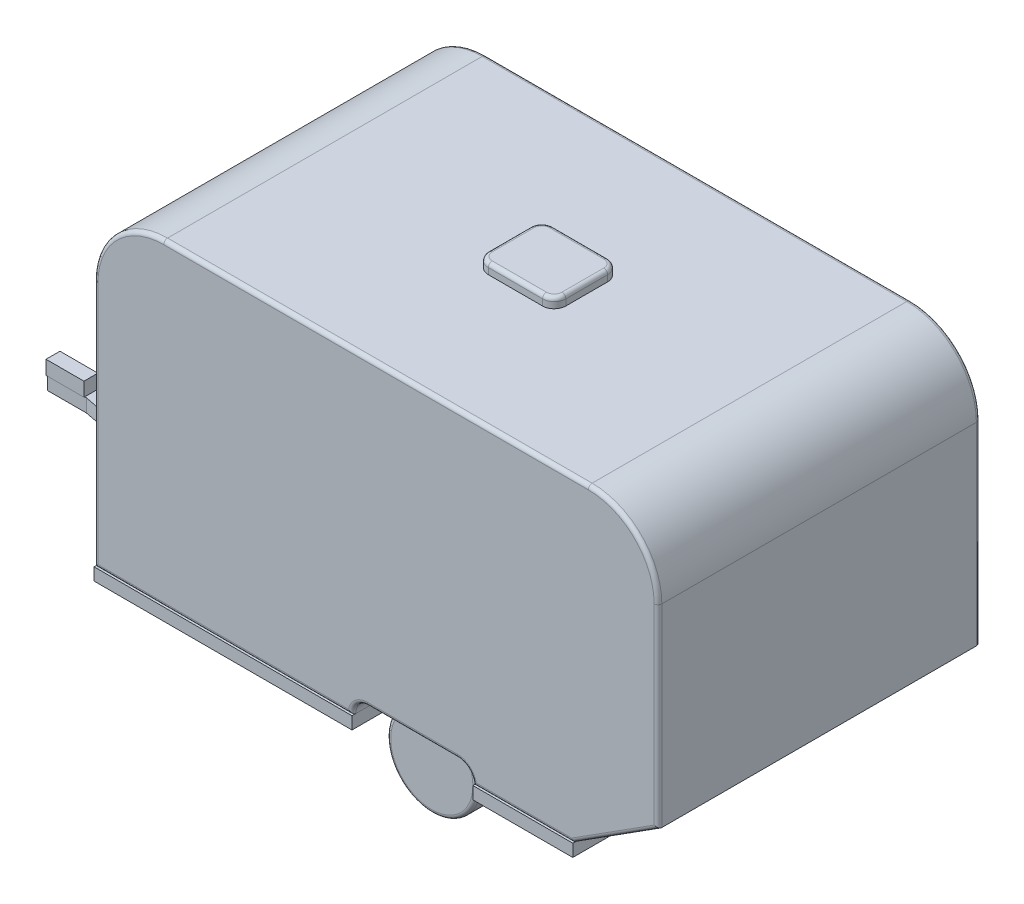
from build123d import *

# Parameters (mm, degrees)
ESQUISSE1_W              = 3090
ESQUISSE1_H              = 2080
ESQUISSE1_W_2            = 3010
ESQUISSE1_H_2            = 2000
BOSS_EXTRU_1_DEPTH       = 80
ESQUISSE2_W              = 3010
ESQUISSE2_H              = 40
ESQUISSE2_W_2            = 40
ESQUISSE2_H_2            = 335
BOSS_EXTRU_7_DEPTH       = 80
BOSS_EXTRU_8_START       = 20
BOSS_EXTRU_8_DEPTH       = 60
ESQUISSE5_W              = 780
ESQUISSE5_H              = 50
ENL_V_MAT_EXTRU_5_DEPTH  = 3726.70798641
ESQUISSE6_W              = 95
ESQUISSE6_H              = 1330
BOSS_EXTRU_9_DEPTH       = 95
CONG_1_R                 = 10
BOSS_EXTRU_10_DEPTH      = 95
BOSS_EXTRU_10_DEPTH_BACK = 1422
ESQUISSE8_R              = 35
ESQUISSE9_R              = 290
BOSS_EXTRU_11_DEPTH      = 155
BOSS_EXTRU_12_START      = 155
ESQUISSE10_R             = 290
BOSS_EXTRU_12_DEPTH      = 155
CONG_2_R                 = 25
BOSS_EXTRU_26_DEPTH      = 85
ESQUISSE12_W             = 245
ESQUISSE12_H             = 90
BOSS_EXTRU_27_DEPTH      = 90
BOSS_EXTRU_28_DEPTH      = 2080
BOSS_EXTRU_29_START      = 25
BOSS_EXTRU_29_DEPTH      = 65
CONG_3_R                 = 25
CONG_4_R                 = 25
BOSS_EXTRU_30_DEPTH      = 30
CONG_5_R                 = 25
BOSS_EXTRU_31_DEPTH      = 30
CONG_6_R                 = 25
ESQUISSE18_R             = 42.5
ENL_V_MAT_EXTRU_6_DEPTH  = 15
ESQUISSE19_W             = 2400
ESQUISSE19_H             = 125
ESQUISSE19_W_2           = 640
ESQUISSE19_H_2           = 40
ENL_V_MAT_EXTRU_7_DEPTH  = 10
ESQUISSE20_W             = 2030
ESQUISSE20_H             = 125
ESQUISSE20_H_2           = 40
ENL_V_MAT_EXTRU_8_DEPTH  = 10
BOSS_EXTRU_33_START      = -500
BOSS_EXTRU_33_DEPTH      = 1080
CONG_7_R                 = 50


with BuildPart() as part:
    # Esquisse1 → Boss.-Extru.1 (new body)
    with BuildSketch(Plane(origin=(0, 0, 0), x_dir=(1, 0, 0), z_dir=(0, 1, 0))):
        with Locations((1545, 1040)):
            Rectangle(ESQUISSE1_W, ESQUISSE1_H)
        with Locations((1545, 1040)):
            Rectangle(ESQUISSE1_W_2, ESQUISSE1_H_2, mode=Mode.SUBTRACT)
    extrude(amount=BOSS_EXTRU_1_DEPTH)

    # Esquisse2 → Boss.-Extru.7 (add)
    with BuildSketch(Plane(origin=(0, 0, 0), x_dir=(1, 0, 0), z_dir=(0, 1, 0))):
        with Locations((1545, 1685)):
            Rectangle(ESQUISSE2_W, ESQUISSE2_H)
        with Locations((1545, 395)):
            Rectangle(ESQUISSE2_W, ESQUISSE2_H)
        with Locations((1645, 1872.5)):
            Rectangle(ESQUISSE2_W_2, ESQUISSE2_H_2)
        with Locations((2465, 1872.5)):
            Rectangle(ESQUISSE2_W_2, ESQUISSE2_H_2)
        with Locations((1645, 207.5)):
            Rectangle(ESQUISSE2_W_2, ESQUISSE2_H_2)
        with Locations((2465, 207.5)):
            Rectangle(ESQUISSE2_W_2, ESQUISSE2_H_2)
    extrude(amount=BOSS_EXTRU_7_DEPTH)

    # Esquisse4 → Boss.-Extru.8 (add)
    with BuildSketch(Plane(origin=(0, 0, 0), x_dir=(1, 0, 0), z_dir=(0, 1, 0)).offset(BOSS_EXTRU_8_START)):
        Polygon((40, 1050), (585, 1050), (585, 1665), (615, 1665), (615, 1050), (1185, 1050), (1185, 1665), (1215, 1665), (1215, 1050), (2745, 1050), (2745, 1665), (2775, 1665), (2775, 1432.5), (3050, 1432.5), (3050, 1412.5), (2775, 1412.5), (2775, 667.5), (3050, 667.5), (3050, 647.5), (2775, 647.5), (2775, 415), (2745, 415), (2745, 1030), (1215, 1030), (1215, 415), (1185, 415), (1185, 1030), (615, 1030), (615, 415), (585, 415), (585, 1030), (40, 1030), align=None)
    extrude(amount=BOSS_EXTRU_8_DEPTH)

    # Esquisse5 → Enl_v. mat.-Extru.5 (cut, through all)
    with BuildSketch(Plane(origin=(0, 0, 0), x_dir=(1, 0, 0), z_dir=(0, 1, 0))):
        with Locations((2055, 2065)):
            Rectangle(ESQUISSE5_W, ESQUISSE5_H)
        with Locations((2055, 15)):
            Rectangle(ESQUISSE5_W, ESQUISSE5_H)
    extrude(amount=ENL_V_MAT_EXTRU_5_DEPTH, mode=Mode.SUBTRACT)

    # Esquisse6 → Boss.-Extru.9 (add)
    with BuildSketch(Plane(origin=(0, 0, 0), x_dir=(1, 0, 0), z_dir=(0, 1, 0))):
        with Locations((2055, 1040)):
            Rectangle(ESQUISSE6_W, ESQUISSE6_H)
    extrude(amount=-BOSS_EXTRU_9_DEPTH)

    # Cong_1
    cong_1_edges = [part.edges().sort_by_distance(p)[0] for p in [
        (2007.5, 0, -1040),
        (2102.5, 0, -1040),
        (2007.5, -95, -1040),
        (2102.5, -95, -1040),
    ]]
    fillet(cong_1_edges, radius=CONG_1_R)

    # Esquisse8 → Boss.-Extru.10 (add, two sides: drawn at the far end of the back side and taken through both)
    with BuildSketch(Plane.XY.offset(-375).offset(-BOSS_EXTRU_10_DEPTH_BACK)):
        with Locations((2055, -47.5)):
            Circle(ESQUISSE8_R)
    extrude(amount=BOSS_EXTRU_10_DEPTH + BOSS_EXTRU_10_DEPTH_BACK)

    # Esquisse9 → Boss.-Extru.11 (add)
    with BuildSketch(Plane.XY.offset(-280)):
        with Locations((2055, -47.5)):
            Circle(ESQUISSE9_R)
    extrude(amount=BOSS_EXTRU_11_DEPTH)

    # Esquisse10 → Boss.-Extru.12 (add)
    with BuildSketch(Plane(origin=(0, 0, -1797), x_dir=(-1, 0, 0), z_dir=(0, 0, -1)).offset(BOSS_EXTRU_12_START)):
        with Locations(Location((-2055, -47.5, 0), (0, 0, 180))):
            Circle(ESQUISSE10_R)
    extrude(amount=-BOSS_EXTRU_12_DEPTH)

    # Cong_2
    cong_2_edges = [part.edges().sort_by_distance(p)[0] for p in [
        (1765, -47.5, -280),
        (1765, -47.5, -125),
        (1765, -47.5, -1797),
        (1765, -47.5, -1952),
    ]]
    fillet(cong_2_edges, radius=CONG_2_R)



with BuildPart() as body_2:
    # Esquisse11 → Boss.-Extru.26 (new body)
    with BuildSketch(Plane.XZ):
        Polygon((-1300, -1080), (-1050, -1080), (2007.5, -1665), (2007.5, -1620), (-1021.254273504, -1040.5), (-1021.254273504, -1039.5), (2007.5, -460), (2007.5, -415), (-1050, -1000), (-1300, -1000), align=None)
    extrude(amount=BOSS_EXTRU_26_DEPTH)

    # Esquisse12 → Boss.-Extru.27 (add)
    with BuildSketch(Plane(origin=(0, 0, 0), x_dir=(1, 0, 0), z_dir=(0, 1, 0))):
        with Locations((-1182.5, 1040)):
            Rectangle(ESQUISSE12_W, ESQUISSE12_H)
    extrude(amount=BOSS_EXTRU_27_DEPTH)


with BuildPart() as body_3:
    # Esquisse14 → Boss.-Extru.28 (new body)
    with BuildSketch(Plane(origin=(0, 0, -2080), x_dir=(-1, 0, 0), z_dir=(0, 0, -1))):
        with BuildLine():
            Line((0, 80), (0, 1680))
            ThreePointArc((0, 1680), (-131.801948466, 1998.198051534), (-450, 2130))
            Line((-450, 2130), (-3190, 2130))
            ThreePointArc((-3190, 2130), (-3508.198051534, 1998.198051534), (-3640, 1680))
            Line((-3640, 1680), (-3640, 430))
            Line((-3640, 430), (-3090, 80))
            Line((-3090, 80), (-2445, 80))
            ThreePointArc((-2445, 80), (-2415.710678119, 150.710678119), (-2345, 180))
            Line((-2345, 180), (-1765, 180))
            ThreePointArc((-1765, 180), (-1694.289321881, 150.710678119), (-1665, 80))
            Line((-1665, 80), (0, 80))
        make_face()
    extrude(amount=-BOSS_EXTRU_28_DEPTH)

    # Cong_4
    cong_4_edges = [body_3.edges().sort_by_distance(p)[0] for p in [
        (131.801948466, 1998.198051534, 0),
        (1694.289321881, 150.710678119, -2080),
        (2055, 180, -2080),
        (2415.710678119, 150.710678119, -2080),
        (2767.5, 80, -2080),
        (3365, 255, -2080),
        (3640, 1055, -2080),
        (3508.198051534, 1998.198051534, -2080),
        (1820, 2130, -2080),
        (1820, 2130, 0),
        (131.801948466, 1998.198051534, -2080),
        (0, 880, -2080),
        (832.5, 80, -2080),
        (3508.198051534, 1998.198051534, 0),
        (3640, 1055, 0),
        (3365, 255, 0),
        (2767.5, 80, 0),
        (2415.710678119, 150.710678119, 0),
        (2055, 180, 0),
        (1694.289321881, 150.710678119, 0),
        (832.5, 80, 0),
        (0, 880, 0),
    ]]
    fillet(cong_4_edges, radius=CONG_4_R)


with BuildPart() as body_4:
    # Esquisse15 → Boss.-Extru.29 (new body)
    with BuildSketch(Plane(origin=(0, 2130, 0), x_dir=(1, 0, 0), z_dir=(0, 1, 0)).offset(BOSS_EXTRU_29_START)):
        with BuildLine():
            Line((1715, 1250), (2065, 1250))
            ThreePointArc((2065, 1250), (2118.033008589, 1228.033008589), (2140, 1175))
            Line((2140, 1175), (2140, 905))
            ThreePointArc((2140, 905), (2118.033008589, 851.966991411), (2065, 830))
            Line((2065, 830), (1715, 830))
            ThreePointArc((1715, 830), (1661.966991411, 851.966991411), (1640, 905))
            Line((1640, 905), (1640, 1175))
            ThreePointArc((1640, 1175), (1661.966991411, 1228.033008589), (1715, 1250))
        make_face()
    extrude(amount=BOSS_EXTRU_29_DEPTH)

    # Cong_3
    cong_3_edges = [body_4.edges().sort_by_distance(p)[0] for p in [
        (2118.033008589, 2220, -851.966991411),
        (2140, 2220, -1040),
        (2118.033008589, 2220, -1228.033008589),
        (1890, 2220, -1250),
        (1661.966991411, 2220, -1228.033008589),
        (1640, 2220, -1040),
        (1661.966991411, 2220, -851.966991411),
        (1890, 2220, -830),
    ]]
    fillet(cong_3_edges, radius=CONG_3_R)


with BuildPart() as part_1:
    add(part.part)

    add(body_3.part)  # Boss.-Extru.30 merges body 3
    # Esquisse16 → Boss.-Extru.30 (add)
    with BuildSketch(Plane(origin=(0, 0, -2080), x_dir=(-1, 0, 0), z_dir=(0, 0, -1))):
        with BuildLine():
            Line((-1215, 105), (-665, 105))
            Line((-665, 105), (-665, 1730))
            ThreePointArc((-665, 1730), (-716.256313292, 1853.743686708), (-840, 1905))
            Line((-840, 1905), (-1040, 1905))
            ThreePointArc((-1040, 1905), (-1163.743686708, 1853.743686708), (-1215, 1730))
            Line((-1215, 1730), (-1215, 105))
        make_face()
        with BuildLine():
            Line((-3335, 1610), (-2585, 1610))
            ThreePointArc((-2585, 1610), (-2531.966991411, 1588.033008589), (-2510, 1535))
            Line((-2510, 1535), (-2510, 1035))
            ThreePointArc((-2510, 1035), (-2531.966991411, 981.966991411), (-2585, 960))
            Line((-2585, 960), (-3335, 960))
            ThreePointArc((-3335, 960), (-3388.033008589, 981.966991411), (-3410, 1035))
            Line((-3410, 1035), (-3410, 1535))
            ThreePointArc((-3410, 1535), (-3388.033008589, 1588.033008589), (-3335, 1610))
        make_face()
    extrude(amount=BOSS_EXTRU_30_DEPTH)

    # Cong_5
    cong_5_edges = [part_1.edges().sort_by_distance(p)[0] for p in [
        (1215, 917.5, -2110),
        (940, 105, -2110),
        (665, 917.5, -2110),
        (716.256313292, 1853.743686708, -2110),
        (940, 1905, -2110),
        (1163.743686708, 1853.743686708, -2110),
        (3388.033008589, 981.966991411, -2110),
        (2960, 960, -2110),
        (2531.966991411, 981.966991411, -2110),
        (2510, 1285, -2110),
        (2531.966991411, 1588.033008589, -2110),
        (2960, 1610, -2110),
        (3388.033008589, 1588.033008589, -2110),
        (3410, 1285, -2110),
    ]]
    fillet(cong_5_edges, radius=CONG_5_R)

    # Esquisse17 → Boss.-Extru.31 (add)
    with BuildSketch(Plane.ZY):
        with BuildLine():
            Line((-1867, 1660), (-217, 1660))
            ThreePointArc((-217, 1660), (-163.966991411, 1638.033008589), (-142, 1585))
            Line((-142, 1585), (-142, 1035))
            ThreePointArc((-142, 1035), (-163.966991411, 981.966991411), (-217, 960))
            Line((-217, 960), (-1867, 960))
            ThreePointArc((-1867, 960), (-1920.033008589, 981.966991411), (-1942, 1035))
            Line((-1942, 1035), (-1942, 1585))
            ThreePointArc((-1942, 1585), (-1920.033008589, 1638.033008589), (-1867, 1660))
        make_face()
    extrude(amount=BOSS_EXTRU_31_DEPTH)

    # Cong_6
    cong_6_edges = [part_1.edges().sort_by_distance(p)[0] for p in [
        (-30, 981.966991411, -1920.033008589),
        (-30, 960, -1042),
        (-30, 981.966991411, -163.966991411),
        (-30, 1310, -142),
        (-30, 1638.033008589, -163.966991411),
        (-30, 1660, -1042),
        (-30, 1638.033008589, -1920.033008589),
        (-30, 1310, -1942),
    ]]
    fillet(cong_6_edges, radius=CONG_6_R)

    # Esquisse18 → Enl_v. mat.-Extru.6 (cut)
    with BuildSketch(Plane(origin=(0, 0, -2110), x_dir=(-1, 0, 0), z_dir=(0, 0, -1))):
        with Locations((-1115, 1080)):
            Circle(ESQUISSE18_R)
    extrude(amount=-ENL_V_MAT_EXTRU_6_DEPTH, mode=Mode.SUBTRACT)

    # Esquisse19 → Enl_v. mat.-Extru.7 (cut)
    with BuildSketch(Plane(origin=(0, 0, -2080), x_dir=(-1, 0, 0), z_dir=(0, 0, -1))):
        with Locations((-2415, 855)):
            Rectangle(ESQUISSE19_W, ESQUISSE19_H)
        with Locations((-345, 855)):
            Rectangle(ESQUISSE19_W_2, ESQUISSE19_H)
        with Locations((-345, 737.5)):
            Rectangle(ESQUISSE19_W_2, ESQUISSE19_H_2)
        with Locations((-2415, 737.5)):
            Rectangle(ESQUISSE19_W, ESQUISSE19_H_2)
    extrude(amount=-ENL_V_MAT_EXTRU_7_DEPTH, mode=Mode.SUBTRACT)

    # Esquisse20 → Enl_v. mat.-Extru.8 (cut)
    with BuildSketch(Plane.ZY):
        with Locations((-1040, 847.5)):
            Rectangle(ESQUISSE20_W, ESQUISSE20_H)
        with Locations((-1040, 735)):
            Rectangle(ESQUISSE20_W, ESQUISSE20_H_2)
    extrude(amount=-ENL_V_MAT_EXTRU_8_DEPTH, mode=Mode.SUBTRACT)


with BuildPart() as body_4_2:
    # Esquisse21 → Boss.-Extru.33 (new body)
    with BuildSketch(Plane(origin=(0, 0, -2080), x_dir=(-1, 0, 0), z_dir=(0, 0, -1)).offset(BOSS_EXTRU_33_START)):
        with BuildLine():
            Line((0, 0), (420, 0))
            Line((420, 0), (420, 420))
            ThreePointArc((420, 420), (416.896983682, 441.350028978), (407.844700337, 460.933404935))
            Line((407.844700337, 460.933404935), (298.967078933, 628.092269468))
            ThreePointArc((298.967078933, 628.092269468), (276.866572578, 650.126401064), (247.711451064, 661.25807775))
            Line((247.711451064, 661.25807775), (0, 700))
            Line((0, 700), (0, 0))
        make_face()
    extrude(amount=-BOSS_EXTRU_33_DEPTH)

    # Cong_7
    cong_7_edges = [body_4_2.edges().sort_by_distance(p)[0] for p in [
        (-420, 210, -500),
        (-416.896983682, 441.350028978, -500),
        (-353.405889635, 544.512837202, -500),
        (-276.866572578, 650.126401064, -500),
        (-123.855725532, 680.629038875, -500),
        (-123.855725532, 680.629038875, -1580),
        (-276.866572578, 650.126401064, -1580),
        (-353.405889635, 544.512837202, -1580),
        (-416.896983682, 441.350028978, -1580),
        (-420, 210, -1580),
    ]]
    fillet(cong_7_edges, radius=CONG_7_R)


solid = Compound([body_2.part, body_4.part, part_1.part, body_4_2.part])
